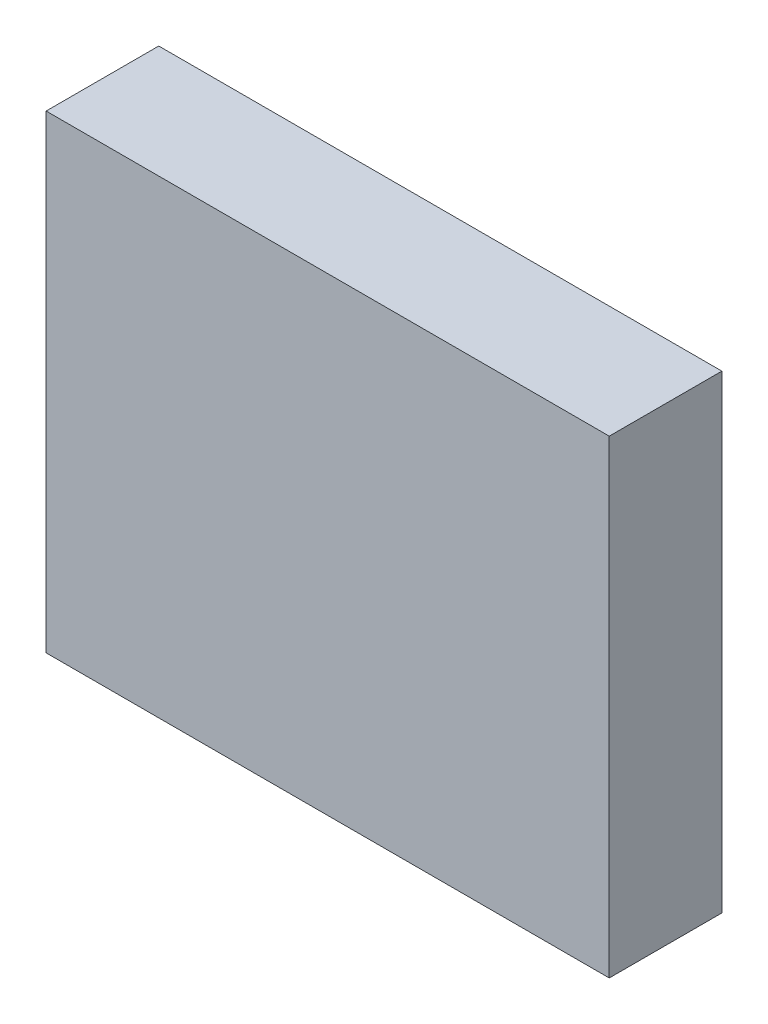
ISO-10303-21;
HEADER;
FILE_DESCRIPTION(('STEP AP214'),'2;1');
FILE_NAME('part.step','',(''),(''),'','','');
FILE_SCHEMA(('AUTOMOTIVE_DESIGN { 1 0 10303 214 1 1 1 1 }'));
ENDSEC;
DATA;
#1=APPLICATION_CONTEXT('core data for automotive mechanical design processes');
#2=APPLICATION_PROTOCOL_DEFINITION('international standard','automotive_design',2000,#1);
#3=PRODUCT_CONTEXT('',#1,'mechanical');
#4=PRODUCT('Part','Part','',(#3));
#5=PRODUCT_RELATED_PRODUCT_CATEGORY('part','',(#4));
#6=PRODUCT_DEFINITION_FORMATION('','',#4);
#7=PRODUCT_DEFINITION_CONTEXT('part definition',#1,'design');
#8=PRODUCT_DEFINITION('design','',#6,#7);
#9=PRODUCT_DEFINITION_SHAPE('','',#8);
#10=(LENGTH_UNIT() NAMED_UNIT(*) SI_UNIT(.MILLI.,.METRE.));
#11=(NAMED_UNIT(*) PLANE_ANGLE_UNIT() SI_UNIT($,.RADIAN.));
#12=(NAMED_UNIT(*) SI_UNIT($,.STERADIAN.) SOLID_ANGLE_UNIT());
#13=UNCERTAINTY_MEASURE_WITH_UNIT(LENGTH_MEASURE(1.E-05),#10,'distance_accuracy_value','');
#14=(GEOMETRIC_REPRESENTATION_CONTEXT(3) GLOBAL_UNCERTAINTY_ASSIGNED_CONTEXT((#13)) GLOBAL_UNIT_ASSIGNED_CONTEXT((#10,
#11,#12)) REPRESENTATION_CONTEXT('',''));
#15=CARTESIAN_POINT('',(0.,0.,0.));
#16=DIRECTION('',(0.,0.,1.));
#17=DIRECTION('',(1.,0.,0.));
#18=AXIS2_PLACEMENT_3D('',#15,#16,#17);
#19=CARTESIAN_POINT('',(0.,0.,12.));
#20=DIRECTION('',(1.,0.,0.));
#21=DIRECTION('',(0.,0.,-1.));
#22=AXIS2_PLACEMENT_3D('',#19,#20,#21);
#23=PLANE('',#22);
#24=DIRECTION('',(0.,-1.,0.));
#25=VECTOR('',#24,1.);
#26=CARTESIAN_POINT('',(0.,0.,0.));
#27=LINE('',#26,#25);
#28=CARTESIAN_POINT('',(0.,50.,0.));
#29=VERTEX_POINT('',#28);
#30=CARTESIAN_POINT('',(0.,0.,0.));
#31=VERTEX_POINT('',#30);
#32=EDGE_CURVE('E102',#29,#31,#27,.T.);
#33=ORIENTED_EDGE('',*,*,#32,.T.);
#34=DIRECTION('',(0.,0.,-1.));
#35=VECTOR('',#34,1.);
#36=CARTESIAN_POINT('',(0.,0.,12.));
#37=LINE('',#36,#35);
#38=CARTESIAN_POINT('',(0.,0.,12.));
#39=VERTEX_POINT('',#38);
#40=EDGE_CURVE('E11',#39,#31,#37,.T.);
#41=ORIENTED_EDGE('',*,*,#40,.F.);
#42=DIRECTION('',(0.,-1.,0.));
#43=VECTOR('',#42,1.);
#44=CARTESIAN_POINT('',(0.,0.,12.));
#45=LINE('',#44,#43);
#46=CARTESIAN_POINT('',(0.,50.,12.));
#47=VERTEX_POINT('',#46);
#48=EDGE_CURVE('E90',#47,#39,#45,.T.);
#49=ORIENTED_EDGE('',*,*,#48,.F.);
#50=DIRECTION('',(0.,0.,-1.));
#51=VECTOR('',#50,1.);
#52=CARTESIAN_POINT('',(0.,50.,12.));
#53=LINE('',#52,#51);
#54=EDGE_CURVE('E98',#47,#29,#53,.T.);
#55=ORIENTED_EDGE('',*,*,#54,.T.);
#56=EDGE_LOOP('',(#33,#41,#49,#55));
#57=FACE_BOUND('',#56,.T.);
#58=ADVANCED_FACE('F39',(#57),#23,.F.);
#59=CARTESIAN_POINT('',(0.,0.,12.));
#60=DIRECTION('',(0.,1.,0.));
#61=DIRECTION('',(0.,0.,1.));
#62=AXIS2_PLACEMENT_3D('',#59,#60,#61);
#63=PLANE('',#62);
#64=DIRECTION('',(1.,0.,0.));
#65=VECTOR('',#64,1.);
#66=CARTESIAN_POINT('',(0.,0.,0.));
#67=LINE('',#66,#65);
#68=CARTESIAN_POINT('',(60.,0.,0.));
#69=VERTEX_POINT('',#68);
#70=EDGE_CURVE('E94',#31,#69,#67,.T.);
#71=ORIENTED_EDGE('',*,*,#70,.T.);
#72=DIRECTION('',(0.,0.,-1.));
#73=VECTOR('',#72,1.);
#74=CARTESIAN_POINT('',(60.,0.,12.));
#75=LINE('',#74,#73);
#76=CARTESIAN_POINT('',(60.,0.,12.));
#77=VERTEX_POINT('',#76);
#78=EDGE_CURVE('E47',#77,#69,#75,.T.);
#79=ORIENTED_EDGE('',*,*,#78,.F.);
#80=DIRECTION('',(1.,0.,0.));
#81=VECTOR('',#80,1.);
#82=CARTESIAN_POINT('',(0.,0.,12.));
#83=LINE('',#82,#81);
#84=EDGE_CURVE('E85',#39,#77,#83,.T.);
#85=ORIENTED_EDGE('',*,*,#84,.F.);
#86=ORIENTED_EDGE('',*,*,#40,.T.);
#87=EDGE_LOOP('',(#71,#79,#85,#86));
#88=FACE_BOUND('',#87,.T.);
#89=ADVANCED_FACE('F93',(#88),#63,.F.);
#90=CARTESIAN_POINT('',(60.,0.,12.));
#91=DIRECTION('',(-1.,0.,0.));
#92=DIRECTION('',(0.,0.,1.));
#93=AXIS2_PLACEMENT_3D('',#90,#91,#92);
#94=PLANE('',#93);
#95=DIRECTION('',(0.,1.,0.));
#96=VECTOR('',#95,1.);
#97=CARTESIAN_POINT('',(60.,0.,0.));
#98=LINE('',#97,#96);
#99=CARTESIAN_POINT('',(60.,50.,0.));
#100=VERTEX_POINT('',#99);
#101=EDGE_CURVE('E72',#69,#100,#98,.T.);
#102=ORIENTED_EDGE('',*,*,#101,.T.);
#103=DIRECTION('',(0.,0.,-1.));
#104=VECTOR('',#103,1.);
#105=CARTESIAN_POINT('',(60.,50.,12.));
#106=LINE('',#105,#104);
#107=CARTESIAN_POINT('',(60.,50.,12.));
#108=VERTEX_POINT('',#107);
#109=EDGE_CURVE('E95',#108,#100,#106,.T.);
#110=ORIENTED_EDGE('',*,*,#109,.F.);
#111=DIRECTION('',(0.,1.,0.));
#112=VECTOR('',#111,1.);
#113=CARTESIAN_POINT('',(60.,0.,12.));
#114=LINE('',#113,#112);
#115=EDGE_CURVE('E88',#77,#108,#114,.T.);
#116=ORIENTED_EDGE('',*,*,#115,.F.);
#117=ORIENTED_EDGE('',*,*,#78,.T.);
#118=EDGE_LOOP('',(#102,#110,#116,#117));
#119=FACE_BOUND('',#118,.T.);
#120=ADVANCED_FACE('F96',(#119),#94,.F.);
#121=CARTESIAN_POINT('',(0.,50.,12.));
#122=DIRECTION('',(0.,-1.,0.));
#123=DIRECTION('',(0.,0.,-1.));
#124=AXIS2_PLACEMENT_3D('',#121,#122,#123);
#125=PLANE('',#124);
#126=DIRECTION('',(-1.,0.,0.));
#127=VECTOR('',#126,1.);
#128=CARTESIAN_POINT('',(0.,50.,0.));
#129=LINE('',#128,#127);
#130=EDGE_CURVE('E78',#100,#29,#129,.T.);
#131=ORIENTED_EDGE('',*,*,#130,.T.);
#132=ORIENTED_EDGE('',*,*,#54,.F.);
#133=DIRECTION('',(-1.,0.,0.));
#134=VECTOR('',#133,1.);
#135=CARTESIAN_POINT('',(0.,50.,12.));
#136=LINE('',#135,#134);
#137=EDGE_CURVE('E55',#108,#47,#136,.T.);
#138=ORIENTED_EDGE('',*,*,#137,.F.);
#139=ORIENTED_EDGE('',*,*,#109,.T.);
#140=EDGE_LOOP('',(#131,#132,#138,#139));
#141=FACE_BOUND('',#140,.T.);
#142=ADVANCED_FACE('F109',(#141),#125,.F.);
#143=CARTESIAN_POINT('',(0.,50.,12.));
#144=DIRECTION('',(0.,0.,-1.));
#145=DIRECTION('',(-1.,0.,0.));
#146=AXIS2_PLACEMENT_3D('',#143,#144,#145);
#147=PLANE('',#146);
#148=ORIENTED_EDGE('',*,*,#48,.T.);
#149=ORIENTED_EDGE('',*,*,#84,.T.);
#150=ORIENTED_EDGE('',*,*,#115,.T.);
#151=ORIENTED_EDGE('',*,*,#137,.T.);
#152=EDGE_LOOP('',(#148,#149,#150,#151));
#153=FACE_BOUND('',#152,.T.);
#154=ADVANCED_FACE('F86',(#153),#147,.F.);
#155=CARTESIAN_POINT('',(0.,50.,0.));
#156=DIRECTION('',(0.,0.,-1.));
#157=DIRECTION('',(-1.,0.,0.));
#158=AXIS2_PLACEMENT_3D('',#155,#156,#157);
#159=PLANE('',#158);
#160=ORIENTED_EDGE('',*,*,#32,.F.);
#161=ORIENTED_EDGE('',*,*,#130,.F.);
#162=ORIENTED_EDGE('',*,*,#101,.F.);
#163=ORIENTED_EDGE('',*,*,#70,.F.);
#164=EDGE_LOOP('',(#160,#161,#162,#163));
#165=FACE_BOUND('',#164,.T.);
#166=ADVANCED_FACE('F112',(#165),#159,.T.);
#167=CLOSED_SHELL('',(#58,#89,#120,#142,#154,#166));
#168=MANIFOLD_SOLID_BREP('B2',#167);
#169=ADVANCED_BREP_SHAPE_REPRESENTATION('',(#18,#168),#14);
#170=SHAPE_DEFINITION_REPRESENTATION(#9,#169);
ENDSEC;
END-ISO-10303-21;
